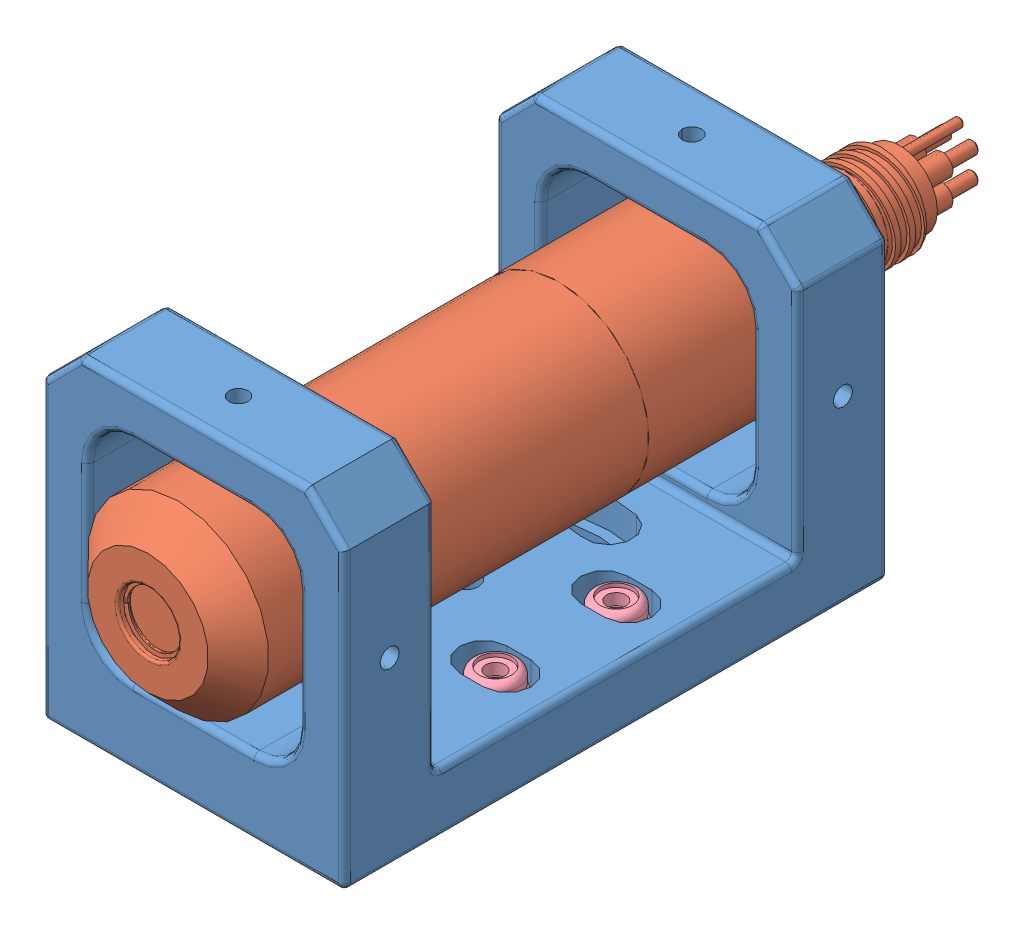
SolidWorks assembly SS501-60010-4LT K4 with Bracket Shell.SLDASM, configuration Default (file format 4400). Lengths in mm.
Overall size (63.5 69.85 170.69).
15 component instances, 4 part files, 9 mates.
Components (placement in the parent):
- 903006101-01 Laser Mounting Bracket-1: 903006101-01 Laser Mounting Bracket.SLDPRT [Default] at origin size (63.5 69.85 114.3)
- 501-61010-4LT K4-2: 501-61010-4LT K4.SLDPRT [Default] at (0 38.1 37.592) size (38.1 38.1 170.69)
- #10-32 X .375 SHSS-1: #10-32 X .375 SHSS.SLDPRT [Default] at (0 57.15 104.775) x (0 -1 0) z (-0.837169 0 -0.546944) size (9.53 4.83 4.83)
- #10-32 LN-1: #10-32 LN.SLDPRT [MSHXNUT 0.190-32-D-N] at (5.281 9.652 81.9949) x (1 0 0) z (0 1 0) (suppressed, hidden)
- #10-32 LN-2: #10-32 LN.SLDPRT [MSHXNUT 0.190-32-D-N] at (19.05 9.652 69.85) x (1 0 0) z (0 1 0)
- #10-32 LN-3: #10-32 LN.SLDPRT [MSHXNUT 0.190-32-D-N] at (-19.05 9.652 69.85) x (1 0 0) z (0 1 0)
- #10-32 LN-4: #10-32 LN.SLDPRT [MSHXNUT 0.190-32-D-N] at (19.05 9.652 44.45) x (1 0 0) z (0 1 0)
- #10-32 LN-5: #10-32 LN.SLDPRT [MSHXNUT 0.190-32-D-N] at (-19.05 9.652 44.45) x (1 0 0) z (0 1 0)
- #10-32 X .375 SHSS-2: #10-32 X .375 SHSS.SLDPRT [Default] at (19.05 38.1 104.775) x (-1 0 0) z (0 0.837169 -0.546944) size (9.53 4.83 4.83)
- #10-32 X .375 SHSS-3: #10-32 X .375 SHSS.SLDPRT [Default] at (0 19.05 104.775) x (0 1 0) z (0.837169 0 -0.546944) size (9.53 4.83 4.83)
- #10-32 X .375 SHSS-4: #10-32 X .375 SHSS.SLDPRT [Default] at (-19.05 38.1 104.775) x (1 0 0) z (0 -0.837169 -0.546944) size (9.53 4.83 4.83)
- #10-32 X .375 SHSS-5: #10-32 X .375 SHSS.SLDPRT [Default] at (0 57.15 9.525) x (0 -1 0) z (-0.837169 0 -0.546944) size (9.53 4.83 4.83)
- #10-32 X .375 SHSS-6: #10-32 X .375 SHSS.SLDPRT [Default] at (19.05 38.1 9.525) x (-1 0 0) z (0 0.837169 -0.546944) size (9.53 4.83 4.83)
- #10-32 X .375 SHSS-7: #10-32 X .375 SHSS.SLDPRT [Default] at (0 19.05 9.525) x (0 1 0) z (0.837169 0 -0.546944) size (9.53 4.83 4.83)
- #10-32 X .375 SHSS-8: #10-32 X .375 SHSS.SLDPRT [Default] at (-19.05 38.1 9.525) x (1 0 0) z (0 -0.837169 -0.546944) size (9.53 4.83 4.83)
Mates (geometry in assembly coordinates):
- Concentric1: concentric anti-aligned: line of 903006101-01 Laser Mounting Bracket-1 through (0 38.1 -5.715) axis (0 0 1); cylinder of 501-61010-4LT K4-2 through (0 38.1 37.592) axis (0 0 -1) radius 19.05
- Distance2: distance = 9.525 mm aligned: plane of 501-61010-4LT K4-2 through (0 57.15 123.825) normal (0 0 1); plane of 903006101-01 Laser Mounting Bracket-1 through (31.75 69.85 114.3) normal (0 0 1)
- Concentric2: concentric anti-aligned: cylinder of #10-32 X .375 SHSS-1 through (0 57.15 104.775) axis (0 -1 0) radius 2.413; cylinder of 903006101-01 Laser Mounting Bracket-1 through (0 69.85 104.775) axis (0 1 0) radius 2.0193
- Tangent1: tangent anti-aligned: cylinder of 501-61010-4LT K4-2 through (0 38.1 37.592) axis (0 0 -1) radius 19.05; plane of #10-32 X .375 SHSS-1 through (0 57.15 104.775) normal (0 -1 0)
- Coincident1: coincident anti-aligned: plane of 903006101-01 Laser Mounting Bracket-1 through (-2.6405 6.35 69.5725) normal (0 1 0); plane of #10-32 LN-1 through (-4.244 6.35 81.9949) normal (0 -1 0)
- Concentric3: concentric anti-aligned: cylinder of 903006101-01 Laser Mounting Bracket-1 through (5.281 6.35 81.9949) axis (0 1 0) radius 4.953; cylinder of #10-32 LN-1 through (5.281 12.827 81.9949) axis (0 -1 0) radius 4.7625
- Coincident2: coincident anti-aligned: plane of 903006101-01 Laser Mounting Bracket-1 through (21.59 6.35 69.85) normal (0 1 0); plane of #10-32 LN-2 through (9.525 6.35 69.85) normal (0 -1 0)
- Concentric4: concentric anti-aligned: cylinder of 903006101-01 Laser Mounting Bracket-1 through (19.05 0 69.85) axis (0 1 0) radius 2.794; cylinder of #10-32 LN-2 through (19.05 12.827 69.85) axis (0 -1 0) radius 4.7625
- LocalLPattern2: unknown: line of 903006101-01 Laser Mounting Bracket-1 through (31.75 11.43 20.32) axis (0 0 1)
